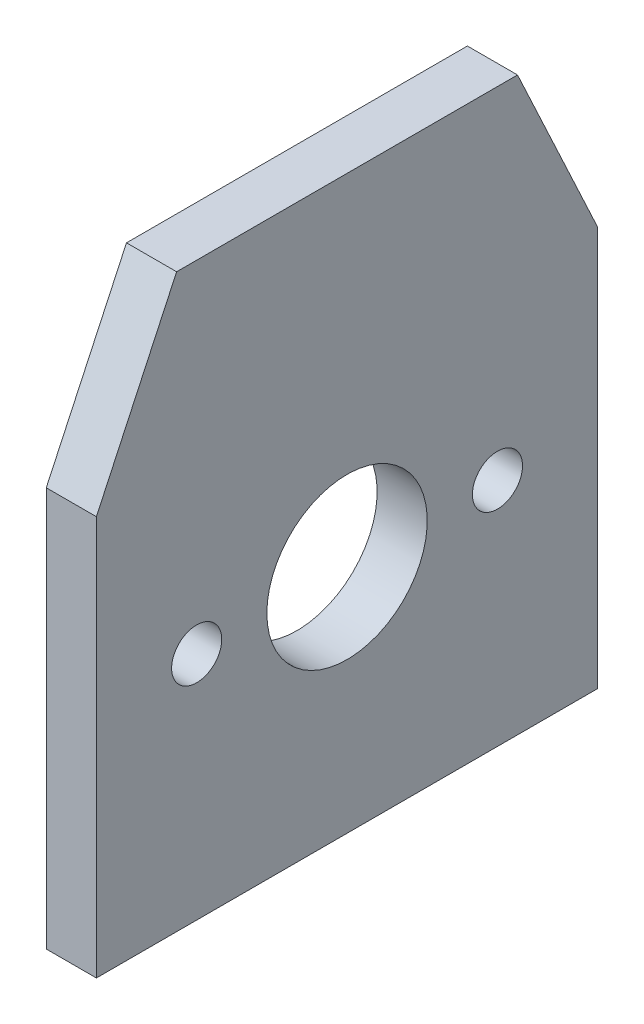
ISO-10303-21;
HEADER;
FILE_DESCRIPTION(('STEP AP214'),'2;1');
FILE_NAME('part.step','',(''),(''),'','','');
FILE_SCHEMA(('AUTOMOTIVE_DESIGN { 1 0 10303 214 1 1 1 1 }'));
ENDSEC;
DATA;
#1=APPLICATION_CONTEXT('core data for automotive mechanical design processes');
#2=APPLICATION_PROTOCOL_DEFINITION('international standard','automotive_design',2000,#1);
#3=PRODUCT_CONTEXT('',#1,'mechanical');
#4=PRODUCT('Part','Part','',(#3));
#5=PRODUCT_RELATED_PRODUCT_CATEGORY('part','',(#4));
#6=PRODUCT_DEFINITION_FORMATION('','',#4);
#7=PRODUCT_DEFINITION_CONTEXT('part definition',#1,'design');
#8=PRODUCT_DEFINITION('design','',#6,#7);
#9=PRODUCT_DEFINITION_SHAPE('','',#8);
#10=(LENGTH_UNIT() NAMED_UNIT(*) SI_UNIT(.MILLI.,.METRE.));
#11=(NAMED_UNIT(*) PLANE_ANGLE_UNIT() SI_UNIT($,.RADIAN.));
#12=(NAMED_UNIT(*) SI_UNIT($,.STERADIAN.) SOLID_ANGLE_UNIT());
#13=UNCERTAINTY_MEASURE_WITH_UNIT(LENGTH_MEASURE(1.E-05),#10,'distance_accuracy_value','');
#14=(GEOMETRIC_REPRESENTATION_CONTEXT(3) GLOBAL_UNCERTAINTY_ASSIGNED_CONTEXT((#13)) GLOBAL_UNIT_ASSIGNED_CONTEXT((#10,
#11,#12)) REPRESENTATION_CONTEXT('',''));
#15=CARTESIAN_POINT('',(0.,0.,0.));
#16=DIRECTION('',(0.,0.,1.));
#17=DIRECTION('',(1.,0.,0.));
#18=AXIS2_PLACEMENT_3D('',#15,#16,#17);
#19=CARTESIAN_POINT('',(5.,39.8439446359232,25.));
#20=DIRECTION('',(0.,0.,-1.));
#21=DIRECTION('',(0.,1.,0.));
#22=AXIS2_PLACEMENT_3D('',#19,#20,#21);
#23=PLANE('',#22);
#24=DIRECTION('',(0.,-1.,0.));
#25=VECTOR('',#24,1.);
#26=CARTESIAN_POINT('',(0.,39.8439446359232,25.));
#27=LINE('',#26,#25);
#28=CARTESIAN_POINT('',(0.,39.8439446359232,25.));
#29=VERTEX_POINT('',#28);
#30=CARTESIAN_POINT('',(0.,0.,25.));
#31=VERTEX_POINT('',#30);
#32=EDGE_CURVE('E116',#29,#31,#27,.T.);
#33=ORIENTED_EDGE('',*,*,#32,.T.);
#34=DIRECTION('',(-1.,0.,0.));
#35=VECTOR('',#34,1.);
#36=CARTESIAN_POINT('',(5.,0.,25.));
#37=LINE('',#36,#35);
#38=CARTESIAN_POINT('',(5.,0.,25.));
#39=VERTEX_POINT('',#38);
#40=EDGE_CURVE('E11',#39,#31,#37,.T.);
#41=ORIENTED_EDGE('',*,*,#40,.F.);
#42=DIRECTION('',(0.,-1.,0.));
#43=VECTOR('',#42,1.);
#44=CARTESIAN_POINT('',(5.,39.8439446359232,25.));
#45=LINE('',#44,#43);
#46=CARTESIAN_POINT('',(5.,39.8439446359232,25.));
#47=VERTEX_POINT('',#46);
#48=EDGE_CURVE('E127',#47,#39,#45,.T.);
#49=ORIENTED_EDGE('',*,*,#48,.F.);
#50=DIRECTION('',(-1.,0.,0.));
#51=VECTOR('',#50,1.);
#52=CARTESIAN_POINT('',(5.,39.8439446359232,25.));
#53=LINE('',#52,#51);
#54=EDGE_CURVE('E112',#47,#29,#53,.T.);
#55=ORIENTED_EDGE('',*,*,#54,.T.);
#56=EDGE_LOOP('',(#33,#41,#49,#55));
#57=FACE_BOUND('',#56,.T.);
#58=ADVANCED_FACE('F32',(#57),#23,.F.);
#59=CARTESIAN_POINT('',(5.,0.,25.));
#60=DIRECTION('',(0.,1.,0.));
#61=DIRECTION('',(0.,0.,1.));
#62=AXIS2_PLACEMENT_3D('',#59,#60,#61);
#63=PLANE('',#62);
#64=DIRECTION('',(0.,0.,-1.));
#65=VECTOR('',#64,1.);
#66=CARTESIAN_POINT('',(0.,0.,25.));
#67=LINE('',#66,#65);
#68=CARTESIAN_POINT('',(0.,0.,-25.));
#69=VERTEX_POINT('',#68);
#70=EDGE_CURVE('E119',#31,#69,#67,.T.);
#71=ORIENTED_EDGE('',*,*,#70,.T.);
#72=DIRECTION('',(-1.,0.,0.));
#73=VECTOR('',#72,1.);
#74=CARTESIAN_POINT('',(5.,0.,-25.));
#75=LINE('',#74,#73);
#76=CARTESIAN_POINT('',(5.,0.,-25.));
#77=VERTEX_POINT('',#76);
#78=EDGE_CURVE('E40',#77,#69,#75,.T.);
#79=ORIENTED_EDGE('',*,*,#78,.F.);
#80=DIRECTION('',(0.,0.,-1.));
#81=VECTOR('',#80,1.);
#82=CARTESIAN_POINT('',(5.,0.,25.));
#83=LINE('',#82,#81);
#84=EDGE_CURVE('E85',#39,#77,#83,.T.);
#85=ORIENTED_EDGE('',*,*,#84,.F.);
#86=ORIENTED_EDGE('',*,*,#40,.T.);
#87=EDGE_LOOP('',(#71,#79,#85,#86));
#88=FACE_BOUND('',#87,.T.);
#89=ADVANCED_FACE('F152',(#88),#63,.F.);
#90=CARTESIAN_POINT('',(5.,39.8439446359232,-25.));
#91=DIRECTION('',(0.,0.,1.));
#92=DIRECTION('',(0.,-1.,0.));
#93=AXIS2_PLACEMENT_3D('',#90,#91,#92);
#94=PLANE('',#93);
#95=DIRECTION('',(0.,1.,0.));
#96=VECTOR('',#95,1.);
#97=CARTESIAN_POINT('',(0.,39.8439446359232,-25.));
#98=LINE('',#97,#96);
#99=CARTESIAN_POINT('',(0.,39.8439446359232,-25.));
#100=VERTEX_POINT('',#99);
#101=EDGE_CURVE('E122',#69,#100,#98,.T.);
#102=ORIENTED_EDGE('',*,*,#101,.T.);
#103=DIRECTION('',(-1.,0.,0.));
#104=VECTOR('',#103,1.);
#105=CARTESIAN_POINT('',(5.,39.8439446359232,-25.));
#106=LINE('',#105,#104);
#107=CARTESIAN_POINT('',(5.,39.8439446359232,-25.));
#108=VERTEX_POINT('',#107);
#109=EDGE_CURVE('E107',#108,#100,#106,.T.);
#110=ORIENTED_EDGE('',*,*,#109,.F.);
#111=DIRECTION('',(0.,1.,0.));
#112=VECTOR('',#111,1.);
#113=CARTESIAN_POINT('',(5.,39.8439446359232,-25.));
#114=LINE('',#113,#112);
#115=EDGE_CURVE('E98',#77,#108,#114,.T.);
#116=ORIENTED_EDGE('',*,*,#115,.F.);
#117=ORIENTED_EDGE('',*,*,#78,.T.);
#118=EDGE_LOOP('',(#102,#110,#116,#117));
#119=FACE_BOUND('',#118,.T.);
#120=ADVANCED_FACE('F133',(#119),#94,.F.);
#121=CARTESIAN_POINT('',(5.,57.,-17.));
#122=DIRECTION('',(0.,-0.422618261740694,0.906307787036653));
#123=DIRECTION('',(0.,-0.906307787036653,-0.422618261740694));
#124=AXIS2_PLACEMENT_3D('',#121,#122,#123);
#125=PLANE('',#124);
#126=DIRECTION('',(0.,0.906307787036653,0.422618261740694));
#127=VECTOR('',#126,1.);
#128=CARTESIAN_POINT('',(0.,57.,-17.));
#129=LINE('',#128,#127);
#130=CARTESIAN_POINT('',(0.,57.,-17.));
#131=VERTEX_POINT('',#130);
#132=EDGE_CURVE('E106',#100,#131,#129,.T.);
#133=ORIENTED_EDGE('',*,*,#132,.T.);
#134=DIRECTION('',(-1.,0.,0.));
#135=VECTOR('',#134,1.);
#136=CARTESIAN_POINT('',(5.,57.,-17.));
#137=LINE('',#136,#135);
#138=CARTESIAN_POINT('',(5.,57.,-17.));
#139=VERTEX_POINT('',#138);
#140=EDGE_CURVE('E103',#139,#131,#137,.T.);
#141=ORIENTED_EDGE('',*,*,#140,.F.);
#142=DIRECTION('',(0.,0.906307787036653,0.422618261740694));
#143=VECTOR('',#142,1.);
#144=CARTESIAN_POINT('',(5.,57.,-17.));
#145=LINE('',#144,#143);
#146=EDGE_CURVE('E92',#108,#139,#145,.T.);
#147=ORIENTED_EDGE('',*,*,#146,.F.);
#148=ORIENTED_EDGE('',*,*,#109,.T.);
#149=EDGE_LOOP('',(#133,#141,#147,#148));
#150=FACE_BOUND('',#149,.T.);
#151=ADVANCED_FACE('F104',(#150),#125,.F.);
#152=CARTESIAN_POINT('',(5.,57.,17.));
#153=DIRECTION('',(0.,-1.,0.));
#154=DIRECTION('',(0.,0.,-1.));
#155=AXIS2_PLACEMENT_3D('',#152,#153,#154);
#156=PLANE('',#155);
#157=DIRECTION('',(0.,0.,1.));
#158=VECTOR('',#157,1.);
#159=CARTESIAN_POINT('',(0.,57.,17.));
#160=LINE('',#159,#158);
#161=CARTESIAN_POINT('',(0.,57.,17.));
#162=VERTEX_POINT('',#161);
#163=EDGE_CURVE('E71',#131,#162,#160,.T.);
#164=ORIENTED_EDGE('',*,*,#163,.T.);
#165=DIRECTION('',(-1.,0.,0.));
#166=VECTOR('',#165,1.);
#167=CARTESIAN_POINT('',(5.,57.,17.));
#168=LINE('',#167,#166);
#169=CARTESIAN_POINT('',(5.,57.,17.));
#170=VERTEX_POINT('',#169);
#171=EDGE_CURVE('E108',#170,#162,#168,.T.);
#172=ORIENTED_EDGE('',*,*,#171,.F.);
#173=DIRECTION('',(0.,0.,1.));
#174=VECTOR('',#173,1.);
#175=CARTESIAN_POINT('',(5.,57.,17.));
#176=LINE('',#175,#174);
#177=EDGE_CURVE('E96',#139,#170,#176,.T.);
#178=ORIENTED_EDGE('',*,*,#177,.F.);
#179=ORIENTED_EDGE('',*,*,#140,.T.);
#180=EDGE_LOOP('',(#164,#172,#178,#179));
#181=FACE_BOUND('',#180,.T.);
#182=ADVANCED_FACE('F110',(#181),#156,.F.);
#183=CARTESIAN_POINT('',(5.,39.8439446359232,25.));
#184=DIRECTION('',(0.,-0.422618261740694,-0.906307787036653));
#185=DIRECTION('',(0.,0.906307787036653,-0.422618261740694));
#186=AXIS2_PLACEMENT_3D('',#183,#184,#185);
#187=PLANE('',#186);
#188=DIRECTION('',(0.,-0.906307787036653,0.422618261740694));
#189=VECTOR('',#188,1.);
#190=CARTESIAN_POINT('',(0.,39.8439446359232,25.));
#191=LINE('',#190,#189);
#192=EDGE_CURVE('E77',#162,#29,#191,.T.);
#193=ORIENTED_EDGE('',*,*,#192,.T.);
#194=ORIENTED_EDGE('',*,*,#54,.F.);
#195=DIRECTION('',(0.,-0.906307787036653,0.422618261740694));
#196=VECTOR('',#195,1.);
#197=CARTESIAN_POINT('',(5.,39.8439446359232,25.));
#198=LINE('',#197,#196);
#199=EDGE_CURVE('E48',#170,#47,#198,.T.);
#200=ORIENTED_EDGE('',*,*,#199,.F.);
#201=ORIENTED_EDGE('',*,*,#171,.T.);
#202=EDGE_LOOP('',(#193,#194,#200,#201));
#203=FACE_BOUND('',#202,.T.);
#204=ADVANCED_FACE('F140',(#203),#187,.F.);
#205=CARTESIAN_POINT('',(5.,0.,0.));
#206=DIRECTION('',(1.,0.,0.));
#207=DIRECTION('',(0.,0.,-1.));
#208=AXIS2_PLACEMENT_3D('',#205,#206,#207);
#209=PLANE('',#208);
#210=CARTESIAN_POINT('',(5.,23.,15.));
#211=DIRECTION('',(-1.,0.,0.));
#212=DIRECTION('',(0.,0.,1.));
#213=AXIS2_PLACEMENT_3D('',#210,#211,#212);
#214=CIRCLE('',#213,2.5);
#215=CARTESIAN_POINT('',(5.,23.,17.5));
#216=VERTEX_POINT('',#215);
#217=EDGE_CURVE('E225',#216,#216,#214,.T.);
#218=ORIENTED_EDGE('',*,*,#217,.T.);
#219=EDGE_LOOP('',(#218));
#220=FACE_BOUND('',#219,.T.);
#221=CARTESIAN_POINT('',(5.,23.,-15.));
#222=DIRECTION('',(-1.,0.,0.));
#223=DIRECTION('',(0.,0.,1.));
#224=AXIS2_PLACEMENT_3D('',#221,#222,#223);
#225=CIRCLE('',#224,2.5);
#226=CARTESIAN_POINT('',(5.,23.,-12.5));
#227=VERTEX_POINT('',#226);
#228=EDGE_CURVE('E239',#227,#227,#225,.T.);
#229=ORIENTED_EDGE('',*,*,#228,.T.);
#230=EDGE_LOOP('',(#229));
#231=FACE_BOUND('',#230,.T.);
#232=CARTESIAN_POINT('',(5.,23.,0.));
#233=DIRECTION('',(-1.,0.,0.));
#234=DIRECTION('',(0.,0.,1.));
#235=AXIS2_PLACEMENT_3D('',#232,#233,#234);
#236=CIRCLE('',#235,8.);
#237=CARTESIAN_POINT('',(5.,23.,8.));
#238=VERTEX_POINT('',#237);
#239=EDGE_CURVE('E120',#238,#238,#236,.T.);
#240=ORIENTED_EDGE('',*,*,#239,.T.);
#241=EDGE_LOOP('',(#240));
#242=FACE_BOUND('',#241,.T.);
#243=ORIENTED_EDGE('',*,*,#48,.T.);
#244=ORIENTED_EDGE('',*,*,#84,.T.);
#245=ORIENTED_EDGE('',*,*,#115,.T.);
#246=ORIENTED_EDGE('',*,*,#146,.T.);
#247=ORIENTED_EDGE('',*,*,#177,.T.);
#248=ORIENTED_EDGE('',*,*,#199,.T.);
#249=EDGE_LOOP('',(#243,#244,#245,#246,#247,#248));
#250=FACE_BOUND('',#249,.T.);
#251=ADVANCED_FACE('F94',(#220,#231,#242,#250),#209,.T.);
#252=CARTESIAN_POINT('',(0.,0.,0.));
#253=DIRECTION('',(1.,0.,0.));
#254=DIRECTION('',(0.,0.,-1.));
#255=AXIS2_PLACEMENT_3D('',#252,#253,#254);
#256=PLANE('',#255);
#257=CARTESIAN_POINT('',(0.,23.,15.));
#258=DIRECTION('',(-1.,0.,0.));
#259=DIRECTION('',(0.,0.,1.));
#260=AXIS2_PLACEMENT_3D('',#257,#258,#259);
#261=CIRCLE('',#260,2.5);
#262=CARTESIAN_POINT('',(0.,23.,17.5));
#263=VERTEX_POINT('',#262);
#264=EDGE_CURVE('E228',#263,#263,#261,.T.);
#265=ORIENTED_EDGE('',*,*,#264,.F.);
#266=EDGE_LOOP('',(#265));
#267=FACE_BOUND('',#266,.T.);
#268=CARTESIAN_POINT('',(0.,23.,-15.));
#269=DIRECTION('',(-1.,0.,0.));
#270=DIRECTION('',(0.,0.,1.));
#271=AXIS2_PLACEMENT_3D('',#268,#269,#270);
#272=CIRCLE('',#271,2.5);
#273=CARTESIAN_POINT('',(0.,23.,-12.5));
#274=VERTEX_POINT('',#273);
#275=EDGE_CURVE('E230',#274,#274,#272,.T.);
#276=ORIENTED_EDGE('',*,*,#275,.F.);
#277=EDGE_LOOP('',(#276));
#278=FACE_BOUND('',#277,.T.);
#279=CARTESIAN_POINT('',(0.,23.,0.));
#280=DIRECTION('',(-1.,0.,0.));
#281=DIRECTION('',(0.,0.,1.));
#282=AXIS2_PLACEMENT_3D('',#279,#280,#281);
#283=CIRCLE('',#282,8.);
#284=CARTESIAN_POINT('',(0.,23.,8.));
#285=VERTEX_POINT('',#284);
#286=EDGE_CURVE('E236',#285,#285,#283,.T.);
#287=ORIENTED_EDGE('',*,*,#286,.F.);
#288=EDGE_LOOP('',(#287));
#289=FACE_BOUND('',#288,.T.);
#290=ORIENTED_EDGE('',*,*,#32,.F.);
#291=ORIENTED_EDGE('',*,*,#192,.F.);
#292=ORIENTED_EDGE('',*,*,#163,.F.);
#293=ORIENTED_EDGE('',*,*,#132,.F.);
#294=ORIENTED_EDGE('',*,*,#101,.F.);
#295=ORIENTED_EDGE('',*,*,#70,.F.);
#296=EDGE_LOOP('',(#290,#291,#292,#293,#294,#295));
#297=FACE_BOUND('',#296,.T.);
#298=ADVANCED_FACE('F136',(#267,#278,#289,#297),#256,.F.);
#299=CARTESIAN_POINT('',(5.,23.,0.));
#300=DIRECTION('',(-1.,0.,0.));
#301=DIRECTION('',(0.,0.,1.));
#302=AXIS2_PLACEMENT_3D('',#299,#300,#301);
#303=CYLINDRICAL_SURFACE('',#302,8.);
#304=ORIENTED_EDGE('',*,*,#239,.F.);
#305=EDGE_LOOP('',(#304));
#306=FACE_BOUND('',#305,.T.);
#307=ORIENTED_EDGE('',*,*,#286,.T.);
#308=EDGE_LOOP('',(#307));
#309=FACE_BOUND('',#308,.T.);
#310=ADVANCED_FACE('F189',(#306,#309),#303,.F.);
#311=CARTESIAN_POINT('',(5.,23.,-15.));
#312=DIRECTION('',(-1.,0.,0.));
#313=DIRECTION('',(0.,0.,1.));
#314=AXIS2_PLACEMENT_3D('',#311,#312,#313);
#315=CYLINDRICAL_SURFACE('',#314,2.5);
#316=ORIENTED_EDGE('',*,*,#228,.F.);
#317=EDGE_LOOP('',(#316));
#318=FACE_BOUND('',#317,.T.);
#319=ORIENTED_EDGE('',*,*,#275,.T.);
#320=EDGE_LOOP('',(#319));
#321=FACE_BOUND('',#320,.T.);
#322=ADVANCED_FACE('F198',(#318,#321),#315,.F.);
#323=CARTESIAN_POINT('',(5.,23.,15.));
#324=DIRECTION('',(-1.,0.,0.));
#325=DIRECTION('',(0.,0.,1.));
#326=AXIS2_PLACEMENT_3D('',#323,#324,#325);
#327=CYLINDRICAL_SURFACE('',#326,2.5);
#328=ORIENTED_EDGE('',*,*,#217,.F.);
#329=EDGE_LOOP('',(#328));
#330=FACE_BOUND('',#329,.T.);
#331=ORIENTED_EDGE('',*,*,#264,.T.);
#332=EDGE_LOOP('',(#331));
#333=FACE_BOUND('',#332,.T.);
#334=ADVANCED_FACE('F208',(#330,#333),#327,.F.);
#335=CLOSED_SHELL('',(#58,#89,#120,#151,#182,#204,#251,#298,#310,#322,#334));
#336=MANIFOLD_SOLID_BREP('B2',#335);
#337=ADVANCED_BREP_SHAPE_REPRESENTATION('',(#18,#336),#14);
#338=SHAPE_DEFINITION_REPRESENTATION(#9,#337);
ENDSEC;
END-ISO-10303-21;
